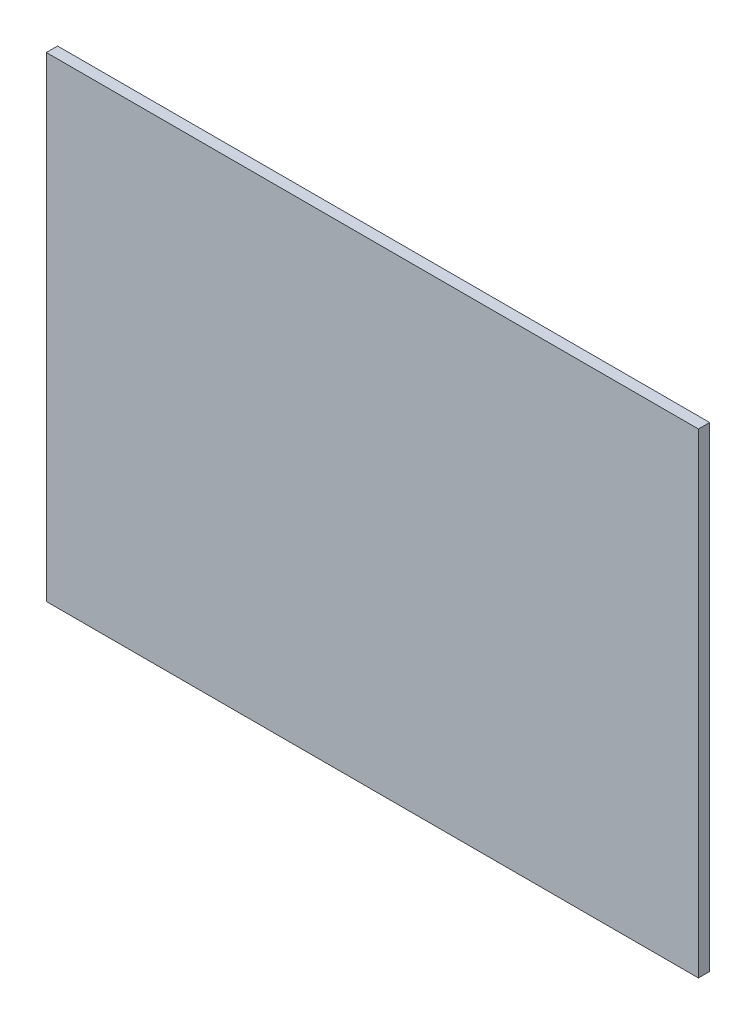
from build123d import *

# Parameters (mm, degrees)
BOSS_EXTRU_1_DEPTH = 10


with BuildPart() as part:
    # Esquisse1 → Boss.-Extru.1 (new body)
    with BuildSketch(Plane.XY):
        Polygon((516.48343687, 14.980313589), (-63.51656313, 14.980313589), (-63.51656313, 4.980313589), (-63.51656313, -397.899686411), (-63.51656313, -407.899686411), (516.48343687, -407.899686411), (516.48343687, -397.899686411), (516.48343687, 4.980313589), align=None)
    extrude(amount=BOSS_EXTRU_1_DEPTH)


solid = part.part
